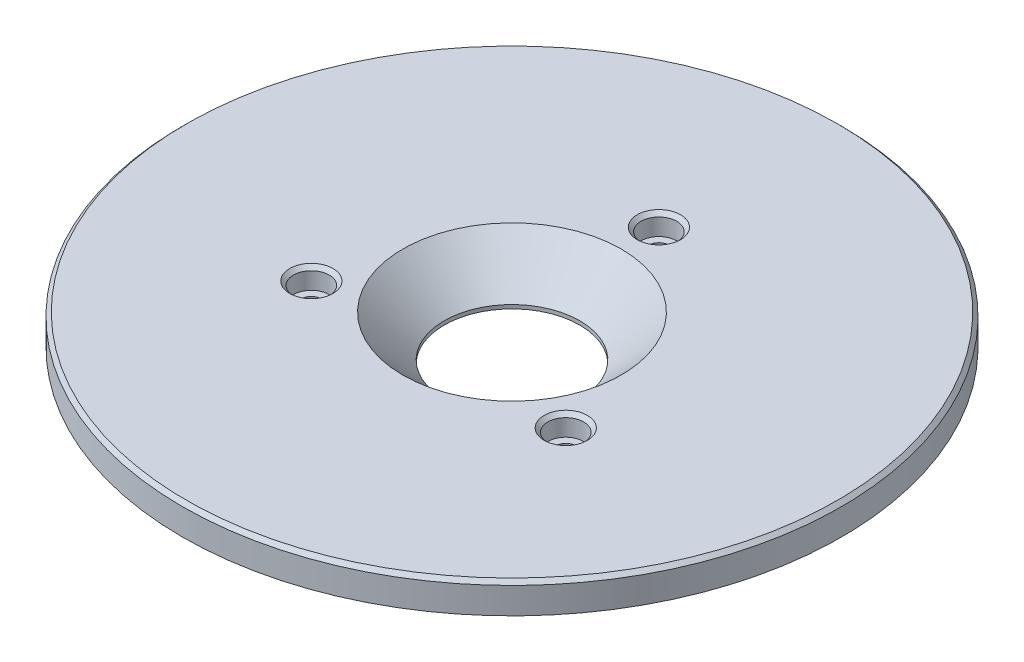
ISO-10303-21;
HEADER;
FILE_DESCRIPTION(('STEP AP214'),'2;1');
FILE_NAME('part.step','',(''),(''),'','','');
FILE_SCHEMA(('AUTOMOTIVE_DESIGN { 1 0 10303 214 1 1 1 1 }'));
ENDSEC;
DATA;
#1=APPLICATION_CONTEXT('core data for automotive mechanical design processes');
#2=APPLICATION_PROTOCOL_DEFINITION('international standard','automotive_design',2000,#1);
#3=PRODUCT_CONTEXT('',#1,'mechanical');
#4=PRODUCT('Part','Part','',(#3));
#5=PRODUCT_RELATED_PRODUCT_CATEGORY('part','',(#4));
#6=PRODUCT_DEFINITION_FORMATION('','',#4);
#7=PRODUCT_DEFINITION_CONTEXT('part definition',#1,'design');
#8=PRODUCT_DEFINITION('design','',#6,#7);
#9=PRODUCT_DEFINITION_SHAPE('','',#8);
#10=(LENGTH_UNIT() NAMED_UNIT(*) SI_UNIT(.MILLI.,.METRE.));
#11=(NAMED_UNIT(*) PLANE_ANGLE_UNIT() SI_UNIT($,.RADIAN.));
#12=(NAMED_UNIT(*) SI_UNIT($,.STERADIAN.) SOLID_ANGLE_UNIT());
#13=UNCERTAINTY_MEASURE_WITH_UNIT(LENGTH_MEASURE(1.E-05),#10,'distance_accuracy_value','');
#14=(GEOMETRIC_REPRESENTATION_CONTEXT(3) GLOBAL_UNCERTAINTY_ASSIGNED_CONTEXT((#13)) GLOBAL_UNIT_ASSIGNED_CONTEXT((#10,
#11,#12)) REPRESENTATION_CONTEXT('',''));
#15=CARTESIAN_POINT('',(0.,0.,0.));
#16=DIRECTION('',(0.,0.,1.));
#17=DIRECTION('',(1.,0.,0.));
#18=AXIS2_PLACEMENT_3D('',#15,#16,#17);
#19=CARTESIAN_POINT('',(-29.,12.,0.));
#20=DIRECTION('',(0.,-1.,0.));
#21=DIRECTION('',(0.,0.,-1.));
#22=AXIS2_PLACEMENT_3D('',#19,#20,#21);
#23=PLANE('',#22);
#24=CARTESIAN_POINT('',(33.7749907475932,12.,19.5));
#25=DIRECTION('',(0.,-1.,0.));
#26=DIRECTION('',(0.,0.,-1.));
#27=AXIS2_PLACEMENT_3D('',#24,#25,#26);
#28=CIRCLE('',#27,5.75);
#29=CARTESIAN_POINT('',(33.7749907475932,12.,13.75));
#30=VERTEX_POINT('',#29);
#31=EDGE_CURVE('E25',#30,#30,#28,.T.);
#32=ORIENTED_EDGE('',*,*,#31,.T.);
#33=EDGE_LOOP('',(#32));
#34=FACE_BOUND('',#33,.T.);
#35=CARTESIAN_POINT('',(0.,12.,-39.));
#36=DIRECTION('',(0.,-1.,0.));
#37=DIRECTION('',(0.,0.,-1.));
#38=AXIS2_PLACEMENT_3D('',#35,#36,#37);
#39=CIRCLE('',#38,5.75);
#40=CARTESIAN_POINT('',(0.,12.,-44.75));
#41=VERTEX_POINT('',#40);
#42=EDGE_CURVE('E29',#41,#41,#39,.T.);
#43=ORIENTED_EDGE('',*,*,#42,.T.);
#44=EDGE_LOOP('',(#43));
#45=FACE_BOUND('',#44,.T.);
#46=CARTESIAN_POINT('',(-33.7749907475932,12.,19.5));
#47=DIRECTION('',(0.,-1.,0.));
#48=DIRECTION('',(0.,0.,-1.));
#49=AXIS2_PLACEMENT_3D('',#46,#47,#48);
#50=CIRCLE('',#49,5.75);
#51=CARTESIAN_POINT('',(-33.7749907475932,12.,13.75));
#52=VERTEX_POINT('',#51);
#53=EDGE_CURVE('E34',#52,#52,#50,.T.);
#54=ORIENTED_EDGE('',*,*,#53,.T.);
#55=EDGE_LOOP('',(#54));
#56=FACE_BOUND('',#55,.T.);
#57=CARTESIAN_POINT('',(0.,12.,0.));
#58=DIRECTION('',(0.,-1.,0.));
#59=DIRECTION('',(0.,0.,-1.));
#60=AXIS2_PLACEMENT_3D('',#57,#58,#59);
#61=CIRCLE('',#60,86.5);
#62=CARTESIAN_POINT('',(0.,12.,-86.5));
#63=VERTEX_POINT('',#62);
#64=EDGE_CURVE('E58',#63,#63,#61,.F.);
#65=ORIENTED_EDGE('',*,*,#64,.T.);
#66=EDGE_LOOP('',(#65));
#67=FACE_BOUND('',#66,.T.);
#68=CARTESIAN_POINT('',(0.,12.,0.));
#69=DIRECTION('',(0.,-1.,0.));
#70=DIRECTION('',(0.,0.,-1.));
#71=AXIS2_PLACEMENT_3D('',#68,#69,#70);
#72=CIRCLE('',#71,29.);
#73=CARTESIAN_POINT('',(0.,12.,-29.));
#74=VERTEX_POINT('',#73);
#75=EDGE_CURVE('E70',#74,#74,#72,.T.);
#76=ORIENTED_EDGE('',*,*,#75,.T.);
#77=EDGE_LOOP('',(#76));
#78=FACE_BOUND('',#77,.T.);
#79=ADVANCED_FACE('F14',(#34,#45,#56,#67,#78),#23,.F.);
#80=CARTESIAN_POINT('',(0.,1.,0.));
#81=DIRECTION('',(0.,1.,0.));
#82=DIRECTION('',(0.,0.,1.));
#83=AXIS2_PLACEMENT_3D('',#80,#81,#82);
#84=CONICAL_SURFACE('',#83,18.,0.78539816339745);
#85=ORIENTED_EDGE('',*,*,#75,.F.);
#86=EDGE_LOOP('',(#85));
#87=FACE_BOUND('',#86,.T.);
#88=CARTESIAN_POINT('',(0.,1.,0.));
#89=DIRECTION('',(0.,-1.,0.));
#90=DIRECTION('',(0.,0.,-1.));
#91=AXIS2_PLACEMENT_3D('',#88,#89,#90);
#92=CIRCLE('',#91,18.);
#93=CARTESIAN_POINT('',(0.,1.,-18.));
#94=VERTEX_POINT('',#93);
#95=EDGE_CURVE('E83',#94,#94,#92,.T.);
#96=ORIENTED_EDGE('',*,*,#95,.T.);
#97=EDGE_LOOP('',(#96));
#98=FACE_BOUND('',#97,.T.);
#99=ADVANCED_FACE('F123',(#87,#98),#84,.F.);
#100=CARTESIAN_POINT('',(0.,0.,0.));
#101=DIRECTION('',(0.,-1.,0.));
#102=DIRECTION('',(0.,0.,-1.));
#103=AXIS2_PLACEMENT_3D('',#100,#101,#102);
#104=CYLINDRICAL_SURFACE('',#103,18.);
#105=ORIENTED_EDGE('',*,*,#95,.F.);
#106=EDGE_LOOP('',(#105));
#107=FACE_BOUND('',#106,.T.);
#108=CARTESIAN_POINT('',(0.,0.,0.));
#109=DIRECTION('',(0.,-1.,0.));
#110=DIRECTION('',(0.,0.,-1.));
#111=AXIS2_PLACEMENT_3D('',#108,#109,#110);
#112=CIRCLE('',#111,18.);
#113=CARTESIAN_POINT('',(0.,0.,-18.));
#114=VERTEX_POINT('',#113);
#115=EDGE_CURVE('E86',#114,#114,#112,.T.);
#116=ORIENTED_EDGE('',*,*,#115,.T.);
#117=EDGE_LOOP('',(#116));
#118=FACE_BOUND('',#117,.T.);
#119=ADVANCED_FACE('F130',(#107,#118),#104,.F.);
#120=CARTESIAN_POINT('',(-18.,0.,0.));
#121=DIRECTION('',(0.,1.,0.));
#122=DIRECTION('',(0.,0.,1.));
#123=AXIS2_PLACEMENT_3D('',#120,#121,#122);
#124=PLANE('',#123);
#125=CARTESIAN_POINT('',(-33.7749907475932,0.,19.5));
#126=DIRECTION('',(0.,1.,0.));
#127=DIRECTION('',(0.,0.,1.));
#128=AXIS2_PLACEMENT_3D('',#125,#126,#127);
#129=CIRCLE('',#128,3.75);
#130=CARTESIAN_POINT('',(-33.7749907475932,0.,23.25));
#131=VERTEX_POINT('',#130);
#132=EDGE_CURVE('E49',#131,#131,#129,.T.);
#133=ORIENTED_EDGE('',*,*,#132,.T.);
#134=EDGE_LOOP('',(#133));
#135=FACE_BOUND('',#134,.T.);
#136=CARTESIAN_POINT('',(33.7749907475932,0.,19.5));
#137=DIRECTION('',(0.,1.,0.));
#138=DIRECTION('',(0.,0.,1.));
#139=AXIS2_PLACEMENT_3D('',#136,#137,#138);
#140=CIRCLE('',#139,3.75);
#141=CARTESIAN_POINT('',(33.7749907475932,0.,23.25));
#142=VERTEX_POINT('',#141);
#143=EDGE_CURVE('E52',#142,#142,#140,.T.);
#144=ORIENTED_EDGE('',*,*,#143,.T.);
#145=EDGE_LOOP('',(#144));
#146=FACE_BOUND('',#145,.T.);
#147=CARTESIAN_POINT('',(0.,0.,-39.));
#148=DIRECTION('',(0.,1.,0.));
#149=DIRECTION('',(0.,0.,1.));
#150=AXIS2_PLACEMENT_3D('',#147,#148,#149);
#151=CIRCLE('',#150,3.75);
#152=CARTESIAN_POINT('',(0.,0.,-35.25));
#153=VERTEX_POINT('',#152);
#154=EDGE_CURVE('E55',#153,#153,#151,.T.);
#155=ORIENTED_EDGE('',*,*,#154,.T.);
#156=EDGE_LOOP('',(#155));
#157=FACE_BOUND('',#156,.T.);
#158=CARTESIAN_POINT('',(0.,0.,0.));
#159=DIRECTION('',(0.,1.,0.));
#160=DIRECTION('',(0.,0.,1.));
#161=AXIS2_PLACEMENT_3D('',#158,#159,#160);
#162=CIRCLE('',#161,44.);
#163=CARTESIAN_POINT('',(0.,0.,44.));
#164=VERTEX_POINT('',#163);
#165=EDGE_CURVE('E67',#164,#164,#162,.F.);
#166=ORIENTED_EDGE('',*,*,#165,.T.);
#167=EDGE_LOOP('',(#166));
#168=FACE_BOUND('',#167,.T.);
#169=ORIENTED_EDGE('',*,*,#115,.F.);
#170=EDGE_LOOP('',(#169));
#171=FACE_BOUND('',#170,.T.);
#172=ADVANCED_FACE('F181',(#135,#146,#157,#168,#171),#124,.F.);
#173=CARTESIAN_POINT('',(0.,0.,0.));
#174=DIRECTION('',(0.,-1.,0.));
#175=DIRECTION('',(0.,0.,-1.));
#176=AXIS2_PLACEMENT_3D('',#173,#174,#175);
#177=CYLINDRICAL_SURFACE('',#176,45.);
#178=CARTESIAN_POINT('',(0.,0.999999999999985,0.));
#179=DIRECTION('',(0.,1.,0.));
#180=DIRECTION('',(0.,0.,1.));
#181=AXIS2_PLACEMENT_3D('',#178,#179,#180);
#182=CIRCLE('',#181,45.);
#183=CARTESIAN_POINT('',(0.,0.999999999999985,45.));
#184=VERTEX_POINT('',#183);
#185=EDGE_CURVE('E64',#184,#184,#182,.T.);
#186=ORIENTED_EDGE('',*,*,#185,.T.);
#187=EDGE_LOOP('',(#186));
#188=FACE_BOUND('',#187,.T.);
#189=CARTESIAN_POINT('',(0.,4.,0.));
#190=DIRECTION('',(0.,-1.,0.));
#191=DIRECTION('',(0.,0.,-1.));
#192=AXIS2_PLACEMENT_3D('',#189,#190,#191);
#193=CIRCLE('',#192,45.);
#194=CARTESIAN_POINT('',(0.,4.,-45.));
#195=VERTEX_POINT('',#194);
#196=EDGE_CURVE('E89',#195,#195,#193,.T.);
#197=ORIENTED_EDGE('',*,*,#196,.T.);
#198=EDGE_LOOP('',(#197));
#199=FACE_BOUND('',#198,.T.);
#200=ADVANCED_FACE('F185',(#188,#199),#177,.T.);
#201=CARTESIAN_POINT('',(-45.,4.,0.));
#202=DIRECTION('',(0.,1.,0.));
#203=DIRECTION('',(0.,0.,1.));
#204=AXIS2_PLACEMENT_3D('',#201,#202,#203);
#205=PLANE('',#204);
#206=ORIENTED_EDGE('',*,*,#196,.F.);
#207=EDGE_LOOP('',(#206));
#208=FACE_BOUND('',#207,.T.);
#209=CARTESIAN_POINT('',(0.,4.,0.));
#210=DIRECTION('',(0.,-1.,0.));
#211=DIRECTION('',(0.,0.,-1.));
#212=AXIS2_PLACEMENT_3D('',#209,#210,#211);
#213=CIRCLE('',#212,87.5);
#214=CARTESIAN_POINT('',(0.,4.,-87.5));
#215=VERTEX_POINT('',#214);
#216=EDGE_CURVE('E92',#215,#215,#213,.T.);
#217=ORIENTED_EDGE('',*,*,#216,.T.);
#218=EDGE_LOOP('',(#217));
#219=FACE_BOUND('',#218,.T.);
#220=ADVANCED_FACE('F192',(#208,#219),#205,.F.);
#221=CARTESIAN_POINT('',(0.,0.,0.));
#222=DIRECTION('',(0.,-1.,0.));
#223=DIRECTION('',(0.,0.,-1.));
#224=AXIS2_PLACEMENT_3D('',#221,#222,#223);
#225=CYLINDRICAL_SURFACE('',#224,87.5);
#226=CARTESIAN_POINT('',(0.,11.,0.));
#227=DIRECTION('',(0.,-1.,0.));
#228=DIRECTION('',(0.,0.,-1.));
#229=AXIS2_PLACEMENT_3D('',#226,#227,#228);
#230=CIRCLE('',#229,87.5);
#231=CARTESIAN_POINT('',(0.,11.,-87.5));
#232=VERTEX_POINT('',#231);
#233=EDGE_CURVE('E61',#232,#232,#230,.T.);
#234=ORIENTED_EDGE('',*,*,#233,.T.);
#235=EDGE_LOOP('',(#234));
#236=FACE_BOUND('',#235,.T.);
#237=ORIENTED_EDGE('',*,*,#216,.F.);
#238=EDGE_LOOP('',(#237));
#239=FACE_BOUND('',#238,.T.);
#240=ADVANCED_FACE('F199',(#236,#239),#225,.T.);
#241=CARTESIAN_POINT('',(33.7749907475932,6.5,19.5));
#242=DIRECTION('',(0.,1.,0.));
#243=DIRECTION('',(0.,0.,1.));
#244=AXIS2_PLACEMENT_3D('',#241,#242,#243);
#245=CYLINDRICAL_SURFACE('',#244,4.75);
#246=CARTESIAN_POINT('',(33.7749907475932,11.,19.5));
#247=DIRECTION('',(0.,-1.,0.));
#248=DIRECTION('',(0.,0.,-1.));
#249=AXIS2_PLACEMENT_3D('',#246,#247,#248);
#250=CIRCLE('',#249,4.75);
#251=CARTESIAN_POINT('',(33.7749907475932,11.,14.75));
#252=VERTEX_POINT('',#251);
#253=EDGE_CURVE('E37',#252,#252,#250,.F.);
#254=ORIENTED_EDGE('',*,*,#253,.T.);
#255=EDGE_LOOP('',(#254));
#256=FACE_BOUND('',#255,.T.);
#257=CARTESIAN_POINT('',(33.7749907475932,6.5,19.5));
#258=DIRECTION('',(0.,1.,0.));
#259=DIRECTION('',(0.,0.,-1.));
#260=AXIS2_PLACEMENT_3D('',#257,#258,#259);
#261=CIRCLE('',#260,4.75);
#262=CARTESIAN_POINT('',(33.7749907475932,6.5,14.75));
#263=VERTEX_POINT('',#262);
#264=EDGE_CURVE('E74',#263,#263,#261,.T.);
#265=ORIENTED_EDGE('',*,*,#264,.F.);
#266=EDGE_LOOP('',(#265));
#267=FACE_BOUND('',#266,.T.);
#268=ADVANCED_FACE('F203',(#256,#267),#245,.F.);
#269=CARTESIAN_POINT('',(33.7749907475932,6.5,19.5));
#270=DIRECTION('',(0.,-1.,0.));
#271=DIRECTION('',(0.,0.,-1.));
#272=AXIS2_PLACEMENT_3D('',#269,#270,#271);
#273=PLANE('',#272);
#274=CARTESIAN_POINT('',(33.7749907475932,6.5,19.5));
#275=DIRECTION('',(0.,-1.,0.));
#276=DIRECTION('',(0.,0.,-1.));
#277=AXIS2_PLACEMENT_3D('',#274,#275,#276);
#278=CIRCLE('',#277,2.75);
#279=CARTESIAN_POINT('',(33.7749907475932,6.5,16.75));
#280=VERTEX_POINT('',#279);
#281=EDGE_CURVE('E71',#280,#280,#278,.T.);
#282=ORIENTED_EDGE('',*,*,#281,.T.);
#283=EDGE_LOOP('',(#282));
#284=FACE_BOUND('',#283,.T.);
#285=ORIENTED_EDGE('',*,*,#264,.T.);
#286=EDGE_LOOP('',(#285));
#287=FACE_BOUND('',#286,.T.);
#288=ADVANCED_FACE('F207',(#284,#287),#273,.F.);
#289=CARTESIAN_POINT('',(-33.7749907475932,6.5,19.5));
#290=DIRECTION('',(0.,1.,0.));
#291=DIRECTION('',(0.,0.,1.));
#292=AXIS2_PLACEMENT_3D('',#289,#290,#291);
#293=CYLINDRICAL_SURFACE('',#292,4.75);
#294=CARTESIAN_POINT('',(-33.7749907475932,11.,19.5));
#295=DIRECTION('',(0.,-1.,0.));
#296=DIRECTION('',(0.,0.,-1.));
#297=AXIS2_PLACEMENT_3D('',#294,#295,#296);
#298=CIRCLE('',#297,4.75);
#299=CARTESIAN_POINT('',(-33.7749907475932,11.,14.75));
#300=VERTEX_POINT('',#299);
#301=EDGE_CURVE('E9',#300,#300,#298,.F.);
#302=ORIENTED_EDGE('',*,*,#301,.T.);
#303=EDGE_LOOP('',(#302));
#304=FACE_BOUND('',#303,.T.);
#305=CARTESIAN_POINT('',(-33.7749907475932,6.5,19.5));
#306=DIRECTION('',(0.,1.,0.));
#307=DIRECTION('',(0.,0.,1.));
#308=AXIS2_PLACEMENT_3D('',#305,#306,#307);
#309=CIRCLE('',#308,4.75);
#310=CARTESIAN_POINT('',(-33.7749907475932,6.5,24.25));
#311=VERTEX_POINT('',#310);
#312=EDGE_CURVE('E98',#311,#311,#309,.T.);
#313=ORIENTED_EDGE('',*,*,#312,.F.);
#314=EDGE_LOOP('',(#313));
#315=FACE_BOUND('',#314,.T.);
#316=ADVANCED_FACE('F119',(#304,#315),#293,.F.);
#317=CARTESIAN_POINT('',(-33.7749907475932,6.5,19.5));
#318=DIRECTION('',(0.,1.,0.));
#319=DIRECTION('',(0.,0.,1.));
#320=AXIS2_PLACEMENT_3D('',#317,#318,#319);
#321=PLANE('',#320);
#322=CARTESIAN_POINT('',(-33.7749907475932,6.5,19.5));
#323=DIRECTION('',(0.,1.,0.));
#324=DIRECTION('',(0.,0.,1.));
#325=AXIS2_PLACEMENT_3D('',#322,#323,#324);
#326=CIRCLE('',#325,2.75);
#327=CARTESIAN_POINT('',(-33.7749907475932,6.5,22.25));
#328=VERTEX_POINT('',#327);
#329=EDGE_CURVE('E75',#328,#328,#326,.T.);
#330=ORIENTED_EDGE('',*,*,#329,.F.);
#331=EDGE_LOOP('',(#330));
#332=FACE_BOUND('',#331,.T.);
#333=ORIENTED_EDGE('',*,*,#312,.T.);
#334=EDGE_LOOP('',(#333));
#335=FACE_BOUND('',#334,.T.);
#336=ADVANCED_FACE('F108',(#332,#335),#321,.T.);
#337=CARTESIAN_POINT('',(0.,6.5,-39.));
#338=DIRECTION('',(0.,1.,0.));
#339=DIRECTION('',(0.,0.,1.));
#340=AXIS2_PLACEMENT_3D('',#337,#338,#339);
#341=CYLINDRICAL_SURFACE('',#340,4.75);
#342=CARTESIAN_POINT('',(0.,11.,-39.));
#343=DIRECTION('',(0.,-1.,0.));
#344=DIRECTION('',(0.,0.,-1.));
#345=AXIS2_PLACEMENT_3D('',#342,#343,#344);
#346=CIRCLE('',#345,4.75);
#347=CARTESIAN_POINT('',(0.,11.,-43.75));
#348=VERTEX_POINT('',#347);
#349=EDGE_CURVE('E21',#348,#348,#346,.F.);
#350=ORIENTED_EDGE('',*,*,#349,.T.);
#351=EDGE_LOOP('',(#350));
#352=FACE_BOUND('',#351,.T.);
#353=CARTESIAN_POINT('',(0.,6.5,-39.));
#354=DIRECTION('',(0.,1.,0.));
#355=DIRECTION('',(0.,0.,1.));
#356=AXIS2_PLACEMENT_3D('',#353,#354,#355);
#357=CIRCLE('',#356,4.75);
#358=CARTESIAN_POINT('',(0.,6.5,-34.25));
#359=VERTEX_POINT('',#358);
#360=EDGE_CURVE('E95',#359,#359,#357,.T.);
#361=ORIENTED_EDGE('',*,*,#360,.F.);
#362=EDGE_LOOP('',(#361));
#363=FACE_BOUND('',#362,.T.);
#364=ADVANCED_FACE('F106',(#352,#363),#341,.F.);
#365=CARTESIAN_POINT('',(0.,6.5,-39.));
#366=DIRECTION('',(0.,1.,0.));
#367=DIRECTION('',(0.,0.,1.));
#368=AXIS2_PLACEMENT_3D('',#365,#366,#367);
#369=PLANE('',#368);
#370=CARTESIAN_POINT('',(0.,6.5,-39.));
#371=DIRECTION('',(0.,1.,0.));
#372=DIRECTION('',(0.,0.,1.));
#373=AXIS2_PLACEMENT_3D('',#370,#371,#372);
#374=CIRCLE('',#373,2.75);
#375=CARTESIAN_POINT('',(0.,6.5,-36.25));
#376=VERTEX_POINT('',#375);
#377=EDGE_CURVE('E78',#376,#376,#374,.T.);
#378=ORIENTED_EDGE('',*,*,#377,.F.);
#379=EDGE_LOOP('',(#378));
#380=FACE_BOUND('',#379,.T.);
#381=ORIENTED_EDGE('',*,*,#360,.T.);
#382=EDGE_LOOP('',(#381));
#383=FACE_BOUND('',#382,.T.);
#384=ADVANCED_FACE('F104',(#380,#383),#369,.T.);
#385=CARTESIAN_POINT('',(0.,0.,-39.));
#386=DIRECTION('',(0.,1.,0.));
#387=DIRECTION('',(0.,0.,1.));
#388=AXIS2_PLACEMENT_3D('',#385,#386,#387);
#389=CYLINDRICAL_SURFACE('',#388,2.75);
#390=CARTESIAN_POINT('',(0.,1.00000000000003,-39.));
#391=DIRECTION('',(0.,1.,0.));
#392=DIRECTION('',(0.,0.,1.));
#393=AXIS2_PLACEMENT_3D('',#390,#391,#392);
#394=CIRCLE('',#393,2.75);
#395=CARTESIAN_POINT('',(0.,1.00000000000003,-36.25));
#396=VERTEX_POINT('',#395);
#397=EDGE_CURVE('E40',#396,#396,#394,.F.);
#398=ORIENTED_EDGE('',*,*,#397,.T.);
#399=EDGE_LOOP('',(#398));
#400=FACE_BOUND('',#399,.T.);
#401=ORIENTED_EDGE('',*,*,#377,.T.);
#402=EDGE_LOOP('',(#401));
#403=FACE_BOUND('',#402,.T.);
#404=ADVANCED_FACE('F116',(#400,#403),#389,.F.);
#405=CARTESIAN_POINT('',(-33.7749907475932,0.,19.5));
#406=DIRECTION('',(0.,1.,0.));
#407=DIRECTION('',(0.,0.,1.));
#408=AXIS2_PLACEMENT_3D('',#405,#406,#407);
#409=CYLINDRICAL_SURFACE('',#408,2.75);
#410=CARTESIAN_POINT('',(-33.7749907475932,1.,19.5));
#411=DIRECTION('',(0.,1.,0.));
#412=DIRECTION('',(0.,0.,1.));
#413=AXIS2_PLACEMENT_3D('',#410,#411,#412);
#414=CIRCLE('',#413,2.75);
#415=CARTESIAN_POINT('',(-33.7749907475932,1.,22.25));
#416=VERTEX_POINT('',#415);
#417=EDGE_CURVE('E46',#416,#416,#414,.F.);
#418=ORIENTED_EDGE('',*,*,#417,.T.);
#419=EDGE_LOOP('',(#418));
#420=FACE_BOUND('',#419,.T.);
#421=ORIENTED_EDGE('',*,*,#329,.T.);
#422=EDGE_LOOP('',(#421));
#423=FACE_BOUND('',#422,.T.);
#424=ADVANCED_FACE('F338',(#420,#423),#409,.F.);
#425=CARTESIAN_POINT('',(33.7749907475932,0.,19.5));
#426=DIRECTION('',(0.,1.,0.));
#427=DIRECTION('',(0.,0.,1.));
#428=AXIS2_PLACEMENT_3D('',#425,#426,#427);
#429=CYLINDRICAL_SURFACE('',#428,2.75);
#430=CARTESIAN_POINT('',(33.7749907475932,1.,19.5));
#431=DIRECTION('',(0.,1.,0.));
#432=DIRECTION('',(0.,0.,1.));
#433=AXIS2_PLACEMENT_3D('',#430,#431,#432);
#434=CIRCLE('',#433,2.75);
#435=CARTESIAN_POINT('',(33.7749907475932,1.,22.25));
#436=VERTEX_POINT('',#435);
#437=EDGE_CURVE('E43',#436,#436,#434,.F.);
#438=ORIENTED_EDGE('',*,*,#437,.T.);
#439=EDGE_LOOP('',(#438));
#440=FACE_BOUND('',#439,.T.);
#441=ORIENTED_EDGE('',*,*,#281,.F.);
#442=EDGE_LOOP('',(#441));
#443=FACE_BOUND('',#442,.T.);
#444=ADVANCED_FACE('F140',(#440,#443),#429,.F.);
#445=CARTESIAN_POINT('',(0.,0.,0.));
#446=DIRECTION('',(0.,1.,0.));
#447=DIRECTION('',(0.,0.,1.));
#448=AXIS2_PLACEMENT_3D('',#445,#446,#447);
#449=CONICAL_SURFACE('',#448,44.,0.785398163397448);
#450=ORIENTED_EDGE('',*,*,#185,.F.);
#451=EDGE_LOOP('',(#450));
#452=FACE_BOUND('',#451,.T.);
#453=ORIENTED_EDGE('',*,*,#165,.F.);
#454=EDGE_LOOP('',(#453));
#455=FACE_BOUND('',#454,.T.);
#456=ADVANCED_FACE('F136',(#452,#455),#449,.T.);
#457=CARTESIAN_POINT('',(0.,11.,0.));
#458=DIRECTION('',(0.,-1.,0.));
#459=DIRECTION('',(0.,0.,-1.));
#460=AXIS2_PLACEMENT_3D('',#457,#458,#459);
#461=CONICAL_SURFACE('',#460,87.5,0.785398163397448);
#462=ORIENTED_EDGE('',*,*,#64,.F.);
#463=EDGE_LOOP('',(#462));
#464=FACE_BOUND('',#463,.T.);
#465=ORIENTED_EDGE('',*,*,#233,.F.);
#466=EDGE_LOOP('',(#465));
#467=FACE_BOUND('',#466,.T.);
#468=ADVANCED_FACE('F139',(#464,#467),#461,.T.);
#469=CARTESIAN_POINT('',(-33.7749907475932,0.,19.5));
#470=DIRECTION('',(0.,-1.,0.));
#471=DIRECTION('',(0.,0.,-1.));
#472=AXIS2_PLACEMENT_3D('',#469,#470,#471);
#473=CONICAL_SURFACE('',#472,3.75,0.785398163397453);
#474=ORIENTED_EDGE('',*,*,#417,.F.);
#475=EDGE_LOOP('',(#474));
#476=FACE_BOUND('',#475,.T.);
#477=ORIENTED_EDGE('',*,*,#132,.F.);
#478=EDGE_LOOP('',(#477));
#479=FACE_BOUND('',#478,.T.);
#480=ADVANCED_FACE('F144',(#476,#479),#473,.F.);
#481=CARTESIAN_POINT('',(33.7749907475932,0.,19.5));
#482=DIRECTION('',(0.,-1.,0.));
#483=DIRECTION('',(0.,0.,-1.));
#484=AXIS2_PLACEMENT_3D('',#481,#482,#483);
#485=CONICAL_SURFACE('',#484,3.75,0.785398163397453);
#486=ORIENTED_EDGE('',*,*,#437,.F.);
#487=EDGE_LOOP('',(#486));
#488=FACE_BOUND('',#487,.T.);
#489=ORIENTED_EDGE('',*,*,#143,.F.);
#490=EDGE_LOOP('',(#489));
#491=FACE_BOUND('',#490,.T.);
#492=ADVANCED_FACE('F148',(#488,#491),#485,.F.);
#493=CARTESIAN_POINT('',(0.,0.,-39.));
#494=DIRECTION('',(0.,-1.,0.));
#495=DIRECTION('',(0.,0.,-1.));
#496=AXIS2_PLACEMENT_3D('',#493,#494,#495);
#497=CONICAL_SURFACE('',#496,3.75,0.785398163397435);
#498=ORIENTED_EDGE('',*,*,#397,.F.);
#499=EDGE_LOOP('',(#498));
#500=FACE_BOUND('',#499,.T.);
#501=ORIENTED_EDGE('',*,*,#154,.F.);
#502=EDGE_LOOP('',(#501));
#503=FACE_BOUND('',#502,.T.);
#504=ADVANCED_FACE('F152',(#500,#503),#497,.F.);
#505=CARTESIAN_POINT('',(33.7749907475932,11.,19.5));
#506=DIRECTION('',(0.,1.,0.));
#507=DIRECTION('',(0.,0.,1.));
#508=AXIS2_PLACEMENT_3D('',#505,#506,#507);
#509=CONICAL_SURFACE('',#508,4.75,0.785398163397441);
#510=ORIENTED_EDGE('',*,*,#31,.F.);
#511=EDGE_LOOP('',(#510));
#512=FACE_BOUND('',#511,.T.);
#513=ORIENTED_EDGE('',*,*,#253,.F.);
#514=EDGE_LOOP('',(#513));
#515=FACE_BOUND('',#514,.T.);
#516=ADVANCED_FACE('F156',(#512,#515),#509,.F.);
#517=CARTESIAN_POINT('',(0.,11.,-39.));
#518=DIRECTION('',(0.,1.,0.));
#519=DIRECTION('',(0.,0.,1.));
#520=AXIS2_PLACEMENT_3D('',#517,#518,#519);
#521=CONICAL_SURFACE('',#520,4.75,0.785398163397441);
#522=ORIENTED_EDGE('',*,*,#42,.F.);
#523=EDGE_LOOP('',(#522));
#524=FACE_BOUND('',#523,.T.);
#525=ORIENTED_EDGE('',*,*,#349,.F.);
#526=EDGE_LOOP('',(#525));
#527=FACE_BOUND('',#526,.T.);
#528=ADVANCED_FACE('F159',(#524,#527),#521,.F.);
#529=CARTESIAN_POINT('',(-33.7749907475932,11.,19.5));
#530=DIRECTION('',(0.,1.,0.));
#531=DIRECTION('',(0.,0.,1.));
#532=AXIS2_PLACEMENT_3D('',#529,#530,#531);
#533=CONICAL_SURFACE('',#532,4.75,0.785398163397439);
#534=ORIENTED_EDGE('',*,*,#53,.F.);
#535=EDGE_LOOP('',(#534));
#536=FACE_BOUND('',#535,.T.);
#537=ORIENTED_EDGE('',*,*,#301,.F.);
#538=EDGE_LOOP('',(#537));
#539=FACE_BOUND('',#538,.T.);
#540=ADVANCED_FACE('F16',(#536,#539),#533,.F.);
#541=CLOSED_SHELL('',(#79,#99,#119,#172,#200,#220,#240,#268,#288,#316,#336,#364,#384,#404,#424,
#444,#456,#468,#480,#492,#504,#516,#528,#540));
#542=MANIFOLD_SOLID_BREP('B1',#541);
#543=ADVANCED_BREP_SHAPE_REPRESENTATION('',(#18,#542),#14);
#544=SHAPE_DEFINITION_REPRESENTATION(#9,#543);
ENDSEC;
END-ISO-10303-21;
